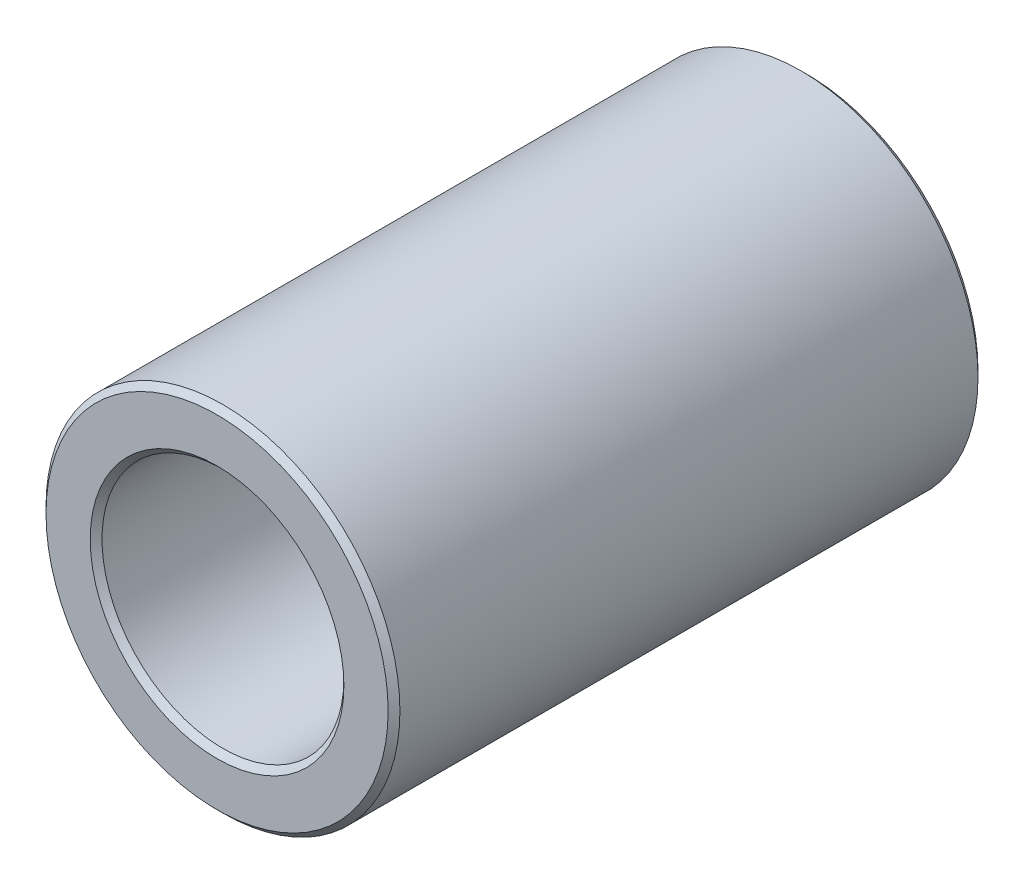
from build123d import *

# Parameters (mm, degrees)
SKETCH1_R           = 6
SKETCH1_R_2         = 4.1
BOSS_EXTRUDE2_DEPTH = 10
CHAMFER3_SIZE       = 0.2


with BuildPart() as part:
    # Sketch1 → Boss-Extrude2 (new, symmetric)
    with BuildSketch(Plane.XY):
        Circle(SKETCH1_R)
        Circle(SKETCH1_R_2, mode=Mode.SUBTRACT)
    extrude(amount=BOSS_EXTRUDE2_DEPTH, both=True)

    # Chamfer3
    chamfer3_edges = [part.edges().sort_by_distance(p)[0] for p in [
        (-6, 0, -10),
        (-6, 0, 10),
        (-4.1, 0, -10),
        (-4.1, 0, 10),
    ]]
    chamfer(chamfer3_edges, length=CHAMFER3_SIZE)


solid = part.part
